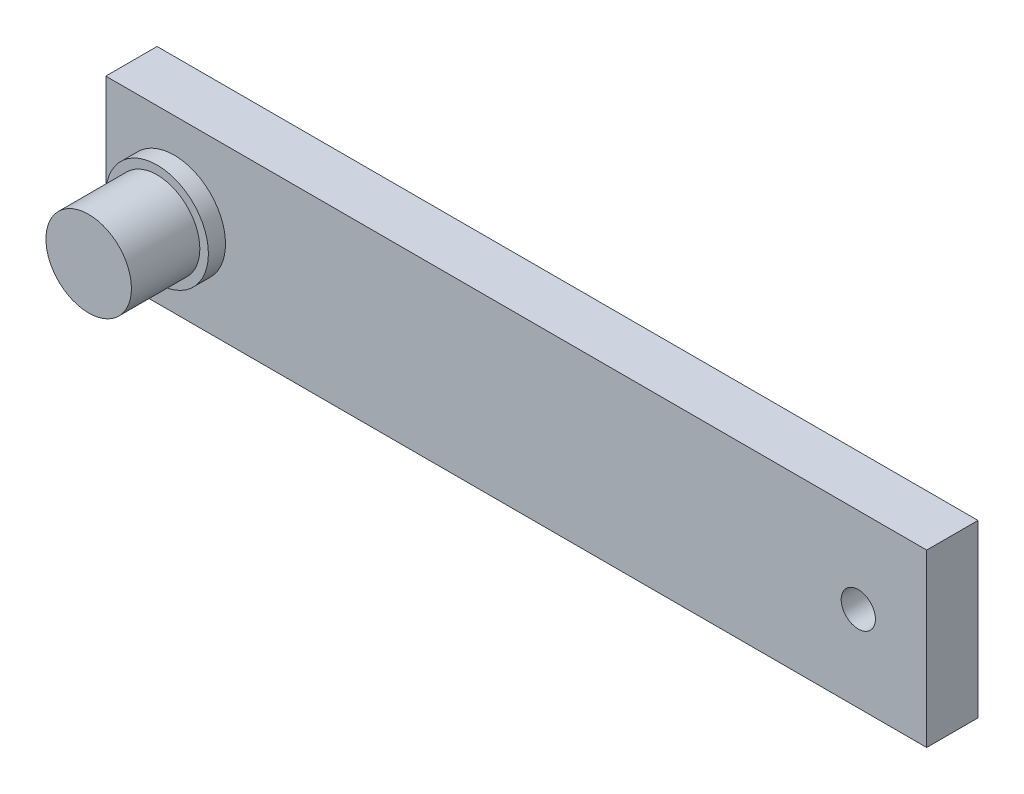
ISO-10303-21;
HEADER;
FILE_DESCRIPTION(('STEP AP214'),'2;1');
FILE_NAME('part.step','',(''),(''),'','','');
FILE_SCHEMA(('AUTOMOTIVE_DESIGN { 1 0 10303 214 1 1 1 1 }'));
ENDSEC;
DATA;
#1=APPLICATION_CONTEXT('core data for automotive mechanical design processes');
#2=APPLICATION_PROTOCOL_DEFINITION('international standard','automotive_design',2000,#1);
#3=PRODUCT_CONTEXT('',#1,'mechanical');
#4=PRODUCT('Part','Part','',(#3));
#5=PRODUCT_RELATED_PRODUCT_CATEGORY('part','',(#4));
#6=PRODUCT_DEFINITION_FORMATION('','',#4);
#7=PRODUCT_DEFINITION_CONTEXT('part definition',#1,'design');
#8=PRODUCT_DEFINITION('design','',#6,#7);
#9=PRODUCT_DEFINITION_SHAPE('','',#8);
#10=(LENGTH_UNIT() NAMED_UNIT(*) SI_UNIT(.MILLI.,.METRE.));
#11=(NAMED_UNIT(*) PLANE_ANGLE_UNIT() SI_UNIT($,.RADIAN.));
#12=(NAMED_UNIT(*) SI_UNIT($,.STERADIAN.) SOLID_ANGLE_UNIT());
#13=UNCERTAINTY_MEASURE_WITH_UNIT(LENGTH_MEASURE(1.E-05),#10,'distance_accuracy_value','');
#14=(GEOMETRIC_REPRESENTATION_CONTEXT(3) GLOBAL_UNCERTAINTY_ASSIGNED_CONTEXT((#13)) GLOBAL_UNIT_ASSIGNED_CONTEXT((#10,
#11,#12)) REPRESENTATION_CONTEXT('',''));
#15=CARTESIAN_POINT('',(0.,0.,0.));
#16=DIRECTION('',(0.,0.,1.));
#17=DIRECTION('',(1.,0.,0.));
#18=AXIS2_PLACEMENT_3D('',#15,#16,#17);
#19=CARTESIAN_POINT('',(40.,50.,40.));
#20=DIRECTION('',(0.,0.,1.));
#21=DIRECTION('',(1.,0.,0.));
#22=AXIS2_PLACEMENT_3D('',#19,#20,#21);
#23=PLANE('',#22);
#24=CARTESIAN_POINT('',(40.,50.,40.));
#25=DIRECTION('',(0.,0.,1.));
#26=DIRECTION('',(1.,0.,0.));
#27=AXIS2_PLACEMENT_3D('',#24,#25,#26);
#28=CIRCLE('',#27,30.);
#29=CARTESIAN_POINT('',(70.,50.,40.));
#30=VERTEX_POINT('',#29);
#31=EDGE_CURVE('E104',#30,#30,#28,.T.);
#32=ORIENTED_EDGE('',*,*,#31,.T.);
#33=EDGE_LOOP('',(#32));
#34=FACE_BOUND('',#33,.T.);
#35=CARTESIAN_POINT('',(40.,50.,40.));
#36=DIRECTION('',(0.,0.,1.));
#37=DIRECTION('',(1.,0.,0.));
#38=AXIS2_PLACEMENT_3D('',#35,#36,#37);
#39=CIRCLE('',#38,25.);
#40=CARTESIAN_POINT('',(65.,50.,40.));
#41=VERTEX_POINT('',#40);
#42=EDGE_CURVE('E157',#41,#41,#39,.T.);
#43=ORIENTED_EDGE('',*,*,#42,.F.);
#44=EDGE_LOOP('',(#43));
#45=FACE_BOUND('',#44,.T.);
#46=ADVANCED_FACE('F33',(#34,#45),#23,.T.);
#47=CARTESIAN_POINT('',(0.,100.,30.));
#48=DIRECTION('',(0.,0.,-1.));
#49=DIRECTION('',(-1.,0.,0.));
#50=AXIS2_PLACEMENT_3D('',#47,#48,#49);
#51=PLANE('',#50);
#52=CARTESIAN_POINT('',(439.999999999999,50.,30.));
#53=DIRECTION('',(0.,0.,1.));
#54=DIRECTION('',(1.,0.,0.));
#55=AXIS2_PLACEMENT_3D('',#52,#53,#54);
#56=CIRCLE('',#55,9.99999999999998);
#57=CARTESIAN_POINT('',(449.999999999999,50.,30.));
#58=VERTEX_POINT('',#57);
#59=EDGE_CURVE('E155',#58,#58,#56,.T.);
#60=ORIENTED_EDGE('',*,*,#59,.F.);
#61=EDGE_LOOP('',(#60));
#62=FACE_BOUND('',#61,.T.);
#63=DIRECTION('',(0.,-1.,0.));
#64=VECTOR('',#63,1.);
#65=CARTESIAN_POINT('',(0.,0.,30.));
#66=LINE('',#65,#64);
#67=CARTESIAN_POINT('',(0.,100.,30.));
#68=VERTEX_POINT('',#67);
#69=CARTESIAN_POINT('',(0.,0.,30.));
#70=VERTEX_POINT('',#69);
#71=EDGE_CURVE('E87',#68,#70,#66,.T.);
#72=ORIENTED_EDGE('',*,*,#71,.T.);
#73=DIRECTION('',(1.,0.,0.));
#74=VECTOR('',#73,1.);
#75=CARTESIAN_POINT('',(0.,0.,30.));
#76=LINE('',#75,#74);
#77=CARTESIAN_POINT('',(480.,0.,30.));
#78=VERTEX_POINT('',#77);
#79=EDGE_CURVE('E81',#70,#78,#76,.T.);
#80=ORIENTED_EDGE('',*,*,#79,.T.);
#81=DIRECTION('',(0.,1.,0.));
#82=VECTOR('',#81,1.);
#83=CARTESIAN_POINT('',(480.,0.,30.));
#84=LINE('',#83,#82);
#85=CARTESIAN_POINT('',(480.,100.,30.));
#86=VERTEX_POINT('',#85);
#87=EDGE_CURVE('E85',#78,#86,#84,.T.);
#88=ORIENTED_EDGE('',*,*,#87,.T.);
#89=DIRECTION('',(-1.,0.,0.));
#90=VECTOR('',#89,1.);
#91=CARTESIAN_POINT('',(0.,100.,30.));
#92=LINE('',#91,#90);
#93=EDGE_CURVE('E50',#86,#68,#92,.T.);
#94=ORIENTED_EDGE('',*,*,#93,.T.);
#95=EDGE_LOOP('',(#72,#80,#88,#94));
#96=FACE_BOUND('',#95,.T.);
#97=CARTESIAN_POINT('',(40.,50.,30.));
#98=DIRECTION('',(0.,0.,-1.));
#99=DIRECTION('',(-1.,0.,0.));
#100=AXIS2_PLACEMENT_3D('',#97,#98,#99);
#101=CIRCLE('',#100,30.);
#102=CARTESIAN_POINT('',(10.,50.,30.));
#103=VERTEX_POINT('',#102);
#104=EDGE_CURVE('E11',#103,#103,#101,.F.);
#105=ORIENTED_EDGE('',*,*,#104,.F.);
#106=EDGE_LOOP('',(#105));
#107=FACE_BOUND('',#106,.T.);
#108=ADVANCED_FACE('F82',(#62,#96,#107),#51,.F.);
#109=CARTESIAN_POINT('',(0.,0.,30.));
#110=DIRECTION('',(1.,0.,0.));
#111=DIRECTION('',(0.,0.,-1.));
#112=AXIS2_PLACEMENT_3D('',#109,#110,#111);
#113=PLANE('',#112);
#114=DIRECTION('',(0.,-1.,0.));
#115=VECTOR('',#114,1.);
#116=CARTESIAN_POINT('',(0.,0.,0.));
#117=LINE('',#116,#115);
#118=CARTESIAN_POINT('',(0.,100.,0.));
#119=VERTEX_POINT('',#118);
#120=CARTESIAN_POINT('',(0.,0.,0.));
#121=VERTEX_POINT('',#120);
#122=EDGE_CURVE('E101',#119,#121,#117,.T.);
#123=ORIENTED_EDGE('',*,*,#122,.T.);
#124=DIRECTION('',(0.,0.,-1.));
#125=VECTOR('',#124,1.);
#126=CARTESIAN_POINT('',(0.,0.,30.));
#127=LINE('',#126,#125);
#128=EDGE_CURVE('E42',#70,#121,#127,.T.);
#129=ORIENTED_EDGE('',*,*,#128,.F.);
#130=ORIENTED_EDGE('',*,*,#71,.F.);
#131=DIRECTION('',(0.,0.,-1.));
#132=VECTOR('',#131,1.);
#133=CARTESIAN_POINT('',(0.,100.,30.));
#134=LINE('',#133,#132);
#135=EDGE_CURVE('E97',#68,#119,#134,.T.);
#136=ORIENTED_EDGE('',*,*,#135,.T.);
#137=EDGE_LOOP('',(#123,#129,#130,#136));
#138=FACE_BOUND('',#137,.T.);
#139=ADVANCED_FACE('F35',(#138),#113,.F.);
#140=CARTESIAN_POINT('',(0.,0.,30.));
#141=DIRECTION('',(0.,1.,0.));
#142=DIRECTION('',(0.,0.,1.));
#143=AXIS2_PLACEMENT_3D('',#140,#141,#142);
#144=PLANE('',#143);
#145=DIRECTION('',(1.,0.,0.));
#146=VECTOR('',#145,1.);
#147=CARTESIAN_POINT('',(0.,0.,0.));
#148=LINE('',#147,#146);
#149=CARTESIAN_POINT('',(480.,0.,0.));
#150=VERTEX_POINT('',#149);
#151=EDGE_CURVE('E92',#121,#150,#148,.T.);
#152=ORIENTED_EDGE('',*,*,#151,.T.);
#153=DIRECTION('',(0.,0.,-1.));
#154=VECTOR('',#153,1.);
#155=CARTESIAN_POINT('',(480.,0.,30.));
#156=LINE('',#155,#154);
#157=EDGE_CURVE('E90',#78,#150,#156,.T.);
#158=ORIENTED_EDGE('',*,*,#157,.F.);
#159=ORIENTED_EDGE('',*,*,#79,.F.);
#160=ORIENTED_EDGE('',*,*,#128,.T.);
#161=EDGE_LOOP('',(#152,#158,#159,#160));
#162=FACE_BOUND('',#161,.T.);
#163=ADVANCED_FACE('F91',(#162),#144,.F.);
#164=CARTESIAN_POINT('',(480.,0.,30.));
#165=DIRECTION('',(-1.,0.,0.));
#166=DIRECTION('',(0.,0.,1.));
#167=AXIS2_PLACEMENT_3D('',#164,#165,#166);
#168=PLANE('',#167);
#169=DIRECTION('',(0.,1.,0.));
#170=VECTOR('',#169,1.);
#171=CARTESIAN_POINT('',(480.,0.,0.));
#172=LINE('',#171,#170);
#173=CARTESIAN_POINT('',(480.,100.,0.));
#174=VERTEX_POINT('',#173);
#175=EDGE_CURVE('E67',#150,#174,#172,.T.);
#176=ORIENTED_EDGE('',*,*,#175,.T.);
#177=DIRECTION('',(0.,0.,-1.));
#178=VECTOR('',#177,1.);
#179=CARTESIAN_POINT('',(480.,100.,30.));
#180=LINE('',#179,#178);
#181=EDGE_CURVE('E93',#86,#174,#180,.T.);
#182=ORIENTED_EDGE('',*,*,#181,.F.);
#183=ORIENTED_EDGE('',*,*,#87,.F.);
#184=ORIENTED_EDGE('',*,*,#157,.T.);
#185=EDGE_LOOP('',(#176,#182,#183,#184));
#186=FACE_BOUND('',#185,.T.);
#187=ADVANCED_FACE('F95',(#186),#168,.F.);
#188=CARTESIAN_POINT('',(0.,100.,30.));
#189=DIRECTION('',(0.,-1.,0.));
#190=DIRECTION('',(0.,0.,-1.));
#191=AXIS2_PLACEMENT_3D('',#188,#189,#190);
#192=PLANE('',#191);
#193=DIRECTION('',(-1.,0.,0.));
#194=VECTOR('',#193,1.);
#195=CARTESIAN_POINT('',(0.,100.,0.));
#196=LINE('',#195,#194);
#197=EDGE_CURVE('E73',#174,#119,#196,.T.);
#198=ORIENTED_EDGE('',*,*,#197,.T.);
#199=ORIENTED_EDGE('',*,*,#135,.F.);
#200=ORIENTED_EDGE('',*,*,#93,.F.);
#201=ORIENTED_EDGE('',*,*,#181,.T.);
#202=EDGE_LOOP('',(#198,#199,#200,#201));
#203=FACE_BOUND('',#202,.T.);
#204=ADVANCED_FACE('F115',(#203),#192,.F.);
#205=CARTESIAN_POINT('',(0.,100.,0.));
#206=DIRECTION('',(0.,0.,-1.));
#207=DIRECTION('',(-1.,0.,0.));
#208=AXIS2_PLACEMENT_3D('',#205,#206,#207);
#209=PLANE('',#208);
#210=CARTESIAN_POINT('',(439.999999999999,50.,0.));
#211=DIRECTION('',(0.,0.,1.));
#212=DIRECTION('',(1.,0.,0.));
#213=AXIS2_PLACEMENT_3D('',#210,#211,#212);
#214=CIRCLE('',#213,9.99999999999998);
#215=CARTESIAN_POINT('',(449.999999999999,50.,0.));
#216=VERTEX_POINT('',#215);
#217=EDGE_CURVE('E152',#216,#216,#214,.T.);
#218=ORIENTED_EDGE('',*,*,#217,.T.);
#219=EDGE_LOOP('',(#218));
#220=FACE_BOUND('',#219,.T.);
#221=ORIENTED_EDGE('',*,*,#122,.F.);
#222=ORIENTED_EDGE('',*,*,#197,.F.);
#223=ORIENTED_EDGE('',*,*,#175,.F.);
#224=ORIENTED_EDGE('',*,*,#151,.F.);
#225=EDGE_LOOP('',(#221,#222,#223,#224));
#226=FACE_BOUND('',#225,.T.);
#227=ADVANCED_FACE('F112',(#220,#226),#209,.T.);
#228=CARTESIAN_POINT('',(40.,50.,40.));
#229=DIRECTION('',(0.,0.,-1.));
#230=DIRECTION('',(-1.,0.,0.));
#231=AXIS2_PLACEMENT_3D('',#228,#229,#230);
#232=CYLINDRICAL_SURFACE('',#231,30.);
#233=ORIENTED_EDGE('',*,*,#31,.F.);
#234=EDGE_LOOP('',(#233));
#235=FACE_BOUND('',#234,.T.);
#236=ORIENTED_EDGE('',*,*,#104,.T.);
#237=EDGE_LOOP('',(#236));
#238=FACE_BOUND('',#237,.T.);
#239=ADVANCED_FACE('F114',(#235,#238),#232,.T.);
#240=CARTESIAN_POINT('',(40.,50.,80.));
#241=DIRECTION('',(0.,0.,-1.));
#242=DIRECTION('',(-1.,0.,0.));
#243=AXIS2_PLACEMENT_3D('',#240,#241,#242);
#244=CYLINDRICAL_SURFACE('',#243,25.);
#245=CARTESIAN_POINT('',(40.,50.,80.));
#246=DIRECTION('',(0.,0.,1.));
#247=DIRECTION('',(1.,0.,0.));
#248=AXIS2_PLACEMENT_3D('',#245,#246,#247);
#249=CIRCLE('',#248,25.);
#250=CARTESIAN_POINT('',(65.,50.,80.));
#251=VERTEX_POINT('',#250);
#252=EDGE_CURVE('E160',#251,#251,#249,.T.);
#253=ORIENTED_EDGE('',*,*,#252,.F.);
#254=EDGE_LOOP('',(#253));
#255=FACE_BOUND('',#254,.T.);
#256=ORIENTED_EDGE('',*,*,#42,.T.);
#257=EDGE_LOOP('',(#256));
#258=FACE_BOUND('',#257,.T.);
#259=ADVANCED_FACE('F122',(#255,#258),#244,.T.);
#260=CARTESIAN_POINT('',(40.,50.,80.));
#261=DIRECTION('',(0.,0.,1.));
#262=DIRECTION('',(1.,0.,0.));
#263=AXIS2_PLACEMENT_3D('',#260,#261,#262);
#264=PLANE('',#263);
#265=ORIENTED_EDGE('',*,*,#252,.T.);
#266=EDGE_LOOP('',(#265));
#267=FACE_BOUND('',#266,.T.);
#268=ADVANCED_FACE('F140',(#267),#264,.T.);
#269=CARTESIAN_POINT('',(439.999999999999,50.,0.));
#270=DIRECTION('',(0.,0.,1.));
#271=DIRECTION('',(1.,0.,0.));
#272=AXIS2_PLACEMENT_3D('',#269,#270,#271);
#273=CYLINDRICAL_SURFACE('',#272,9.99999999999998);
#274=ORIENTED_EDGE('',*,*,#217,.F.);
#275=EDGE_LOOP('',(#274));
#276=FACE_BOUND('',#275,.T.);
#277=ORIENTED_EDGE('',*,*,#59,.T.);
#278=EDGE_LOOP('',(#277));
#279=FACE_BOUND('',#278,.T.);
#280=ADVANCED_FACE('F144',(#276,#279),#273,.F.);
#281=CLOSED_SHELL('',(#46,#108,#139,#163,#187,#204,#227,#239,#259,#268,#280));
#282=MANIFOLD_SOLID_BREP('B2',#281);
#283=ADVANCED_BREP_SHAPE_REPRESENTATION('',(#18,#282),#14);
#284=SHAPE_DEFINITION_REPRESENTATION(#9,#283);
ENDSEC;
END-ISO-10303-21;
